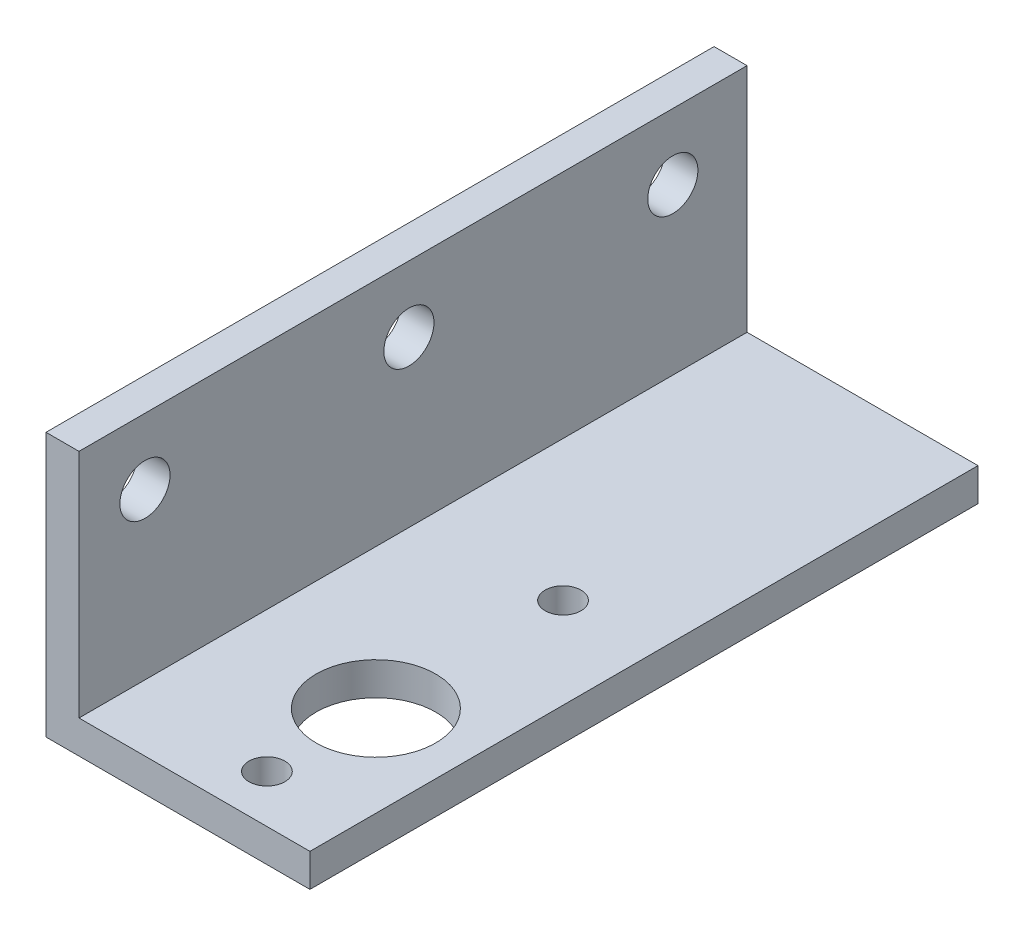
from build123d import *

# Parameters (mm, degrees)
BOSS_EXTRUDE1_DEPTH   = 64.29375
CUT_EXTRUDE1_REACH    = 74.614
SKETCH2_R             = 5.7531
F_5_CLEARANCE_HOLE1_D = 3.4544
CUT_EXTRUDE2_REACH    = 74.614
SKETCH13_R            = 2.413


with BuildPart() as part:
    # Sketch1 → Boss-Extrude1 (new body)
    with BuildSketch(Plane.XY):
        Polygon((0, 0), (0, -25.4), (25.4, -25.4), (25.4, -22.225), (3.175, -22.225), (3.175, 0), align=None)
    extrude(amount=BOSS_EXTRUDE1_DEPTH)

    # Sketch2 → Cut-Extrude1 (cut, up to next)
    with BuildSketch(Plane(origin=(0, -22.225, 0), x_dir=(1, 0, 0), z_dir=(0, 1, 0)), mode=Mode.PRIVATE) as cut_extrude1_sk1:
        with Locations(Location((16.66875, -49.2125, 0), (0, 0, 180))):
            Circle(SKETCH2_R)
    cut_extrude1_tool1 = extrude(cut_extrude1_sk1.sketch, amount=-CUT_EXTRUDE1_REACH, mode=Mode.PRIVATE) & part.part
    add(cut_extrude1_tool1.solids().sort_by_distance((16.66875, -22.225, 49.2125))[0], mode=Mode.SUBTRACT)

    # 5 Clearance Hole1 (through all)
    with Locations(Plane(origin=(0, -22.225, 0), x_dir=(-1, 0, 0), z_dir=(0, 1, 0))):
        with Locations((-16.66875, 31.2039), (-16.66875, 59.7027)):
            Hole(F_5_CLEARANCE_HOLE1_D / 2)

    # Sketch13 → Cut-Extrude2 (cut, up to next)
    with BuildSketch(Plane(origin=(3.175, 0, 0), x_dir=(0, 0, -1), z_dir=(1, 0, 0)), mode=Mode.PRIVATE) as cut_extrude2_sk1:
        with Locations(Location((-57.94375, -6.35, 0), (0, 0, 90))):
            Circle(SKETCH13_R)
    cut_extrude2_tool1 = extrude(cut_extrude2_sk1.sketch, amount=-CUT_EXTRUDE2_REACH, mode=Mode.PRIVATE) & part.part
    # Sketch13 → Cut-Extrude2 (cut, up to next)
    with BuildSketch(Plane(origin=(3.175, 0, 0), x_dir=(0, 0, -1), z_dir=(1, 0, 0)), mode=Mode.PRIVATE) as cut_extrude2_sk2:
        with Locations(Location((-32.54375, -6.35, 0), (0, 0, 90))):
            Circle(SKETCH13_R)
    cut_extrude2_tool2 = extrude(cut_extrude2_sk2.sketch, amount=-CUT_EXTRUDE2_REACH, mode=Mode.PRIVATE) & part.part
    # Sketch13 → Cut-Extrude2 (cut, up to next)
    with BuildSketch(Plane(origin=(3.175, 0, 0), x_dir=(0, 0, -1), z_dir=(1, 0, 0)), mode=Mode.PRIVATE) as cut_extrude2_sk3:
        with Locations(Location((-7.14375, -6.35, 0), (0, 0, 90))):
            Circle(SKETCH13_R)
    cut_extrude2_tool3 = extrude(cut_extrude2_sk3.sketch, amount=-CUT_EXTRUDE2_REACH, mode=Mode.PRIVATE) & part.part
    add(cut_extrude2_tool1.solids().sort_by_distance((3.175, -6.35, 57.94375))[0], mode=Mode.SUBTRACT)
    add(cut_extrude2_tool2.solids().sort_by_distance((3.175, -6.35, 32.54375))[0], mode=Mode.SUBTRACT)
    add(cut_extrude2_tool3.solids().sort_by_distance((3.175, -6.35, 7.14375))[0], mode=Mode.SUBTRACT)


solid = part.part
